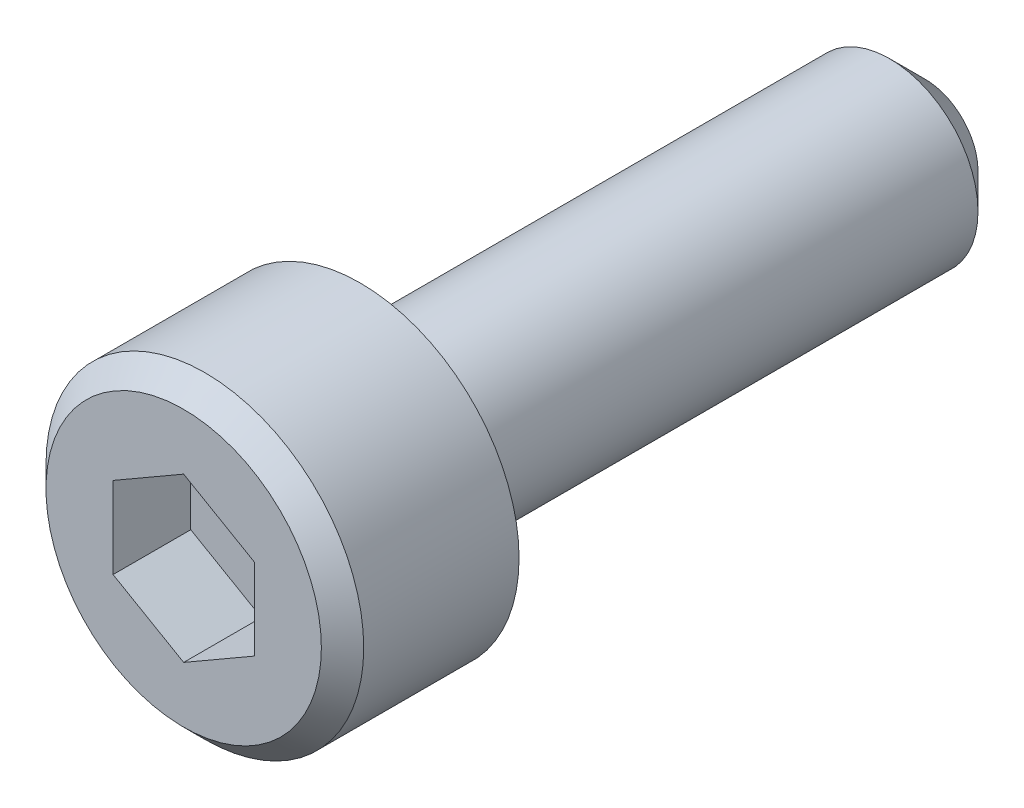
ISO-10303-21;
HEADER;
FILE_DESCRIPTION(('STEP AP214'),'2;1');
FILE_NAME('part.step','',(''),(''),'','','');
FILE_SCHEMA(('AUTOMOTIVE_DESIGN { 1 0 10303 214 1 1 1 1 }'));
ENDSEC;
DATA;
#1=APPLICATION_CONTEXT('core data for automotive mechanical design processes');
#2=APPLICATION_PROTOCOL_DEFINITION('international standard','automotive_design',2000,#1);
#3=PRODUCT_CONTEXT('',#1,'mechanical');
#4=PRODUCT('Part','Part','',(#3));
#5=PRODUCT_RELATED_PRODUCT_CATEGORY('part','',(#4));
#6=PRODUCT_DEFINITION_FORMATION('','',#4);
#7=PRODUCT_DEFINITION_CONTEXT('part definition',#1,'design');
#8=PRODUCT_DEFINITION('design','',#6,#7);
#9=PRODUCT_DEFINITION_SHAPE('','',#8);
#10=(LENGTH_UNIT() NAMED_UNIT(*) SI_UNIT(.MILLI.,.METRE.));
#11=(NAMED_UNIT(*) PLANE_ANGLE_UNIT() SI_UNIT($,.RADIAN.));
#12=(NAMED_UNIT(*) SI_UNIT($,.STERADIAN.) SOLID_ANGLE_UNIT());
#13=UNCERTAINTY_MEASURE_WITH_UNIT(LENGTH_MEASURE(1.E-05),#10,'distance_accuracy_value','');
#14=(GEOMETRIC_REPRESENTATION_CONTEXT(3) GLOBAL_UNCERTAINTY_ASSIGNED_CONTEXT((#13)) GLOBAL_UNIT_ASSIGNED_CONTEXT((#10,
#11,#12)) REPRESENTATION_CONTEXT('',''));
#15=CARTESIAN_POINT('',(0.,0.,0.));
#16=DIRECTION('',(0.,0.,1.));
#17=DIRECTION('',(1.,0.,0.));
#18=AXIS2_PLACEMENT_3D('',#15,#16,#17);
#19=CARTESIAN_POINT('',(0.,0.,2.5));
#20=DIRECTION('',(0.,0.,-1.));
#21=DIRECTION('',(-1.,0.,0.));
#22=AXIS2_PLACEMENT_3D('',#19,#20,#21);
#23=CYLINDRICAL_SURFACE('',#22,2.25);
#24=CARTESIAN_POINT('',(0.,0.,2.2));
#25=DIRECTION('',(0.,0.,1.));
#26=DIRECTION('',(1.,0.,0.));
#27=AXIS2_PLACEMENT_3D('',#24,#25,#26);
#28=CIRCLE('',#27,2.25);
#29=CARTESIAN_POINT('',(2.25,0.,2.2));
#30=VERTEX_POINT('',#29);
#31=EDGE_CURVE('E146',#30,#30,#28,.F.);
#32=ORIENTED_EDGE('',*,*,#31,.T.);
#33=EDGE_LOOP('',(#32));
#34=FACE_BOUND('',#33,.T.);
#35=CARTESIAN_POINT('',(0.,0.,0.));
#36=DIRECTION('',(0.,0.,1.));
#37=DIRECTION('',(1.,0.,0.));
#38=AXIS2_PLACEMENT_3D('',#35,#36,#37);
#39=CIRCLE('',#38,2.25);
#40=CARTESIAN_POINT('',(2.25,0.,0.));
#41=VERTEX_POINT('',#40);
#42=EDGE_CURVE('E139',#41,#41,#39,.T.);
#43=ORIENTED_EDGE('',*,*,#42,.T.);
#44=EDGE_LOOP('',(#43));
#45=FACE_BOUND('',#44,.T.);
#46=ADVANCED_FACE('F17',(#34,#45),#23,.T.);
#47=CARTESIAN_POINT('',(0.,0.,2.5));
#48=DIRECTION('',(0.,0.,1.));
#49=DIRECTION('',(1.,0.,0.));
#50=AXIS2_PLACEMENT_3D('',#47,#48,#49);
#51=PLANE('',#50);
#52=CARTESIAN_POINT('',(0.,0.,2.5));
#53=DIRECTION('',(0.,0.,1.));
#54=DIRECTION('',(1.,0.,0.));
#55=AXIS2_PLACEMENT_3D('',#52,#53,#54);
#56=CIRCLE('',#55,1.95);
#57=CARTESIAN_POINT('',(1.95,0.,2.5));
#58=VERTEX_POINT('',#57);
#59=EDGE_CURVE('E143',#58,#58,#56,.T.);
#60=ORIENTED_EDGE('',*,*,#59,.T.);
#61=EDGE_LOOP('',(#60));
#62=FACE_BOUND('',#61,.T.);
#63=DIRECTION('',(-0.866025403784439,0.5,0.));
#64=VECTOR('',#63,1.);
#65=CARTESIAN_POINT('',(1.,0.577350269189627,2.5));
#66=LINE('',#65,#64);
#67=CARTESIAN_POINT('',(1.,0.577350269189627,2.5));
#68=VERTEX_POINT('',#67);
#69=CARTESIAN_POINT('',(0.,1.15470053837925,2.5));
#70=VERTEX_POINT('',#69);
#71=EDGE_CURVE('E33',#68,#70,#66,.T.);
#72=ORIENTED_EDGE('',*,*,#71,.F.);
#73=DIRECTION('',(0.,1.,0.));
#74=VECTOR('',#73,1.);
#75=CARTESIAN_POINT('',(1.,-0.577350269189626,2.5));
#76=LINE('',#75,#74);
#77=CARTESIAN_POINT('',(1.,-0.577350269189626,2.5));
#78=VERTEX_POINT('',#77);
#79=EDGE_CURVE('E124',#78,#68,#76,.T.);
#80=ORIENTED_EDGE('',*,*,#79,.F.);
#81=DIRECTION('',(0.866025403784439,0.5,0.));
#82=VECTOR('',#81,1.);
#83=CARTESIAN_POINT('',(0.,-1.15470053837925,2.5));
#84=LINE('',#83,#82);
#85=CARTESIAN_POINT('',(0.,-1.15470053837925,2.5));
#86=VERTEX_POINT('',#85);
#87=EDGE_CURVE('E121',#86,#78,#84,.T.);
#88=ORIENTED_EDGE('',*,*,#87,.F.);
#89=DIRECTION('',(0.866025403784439,-0.5,0.));
#90=VECTOR('',#89,1.);
#91=CARTESIAN_POINT('',(-1.,-0.577350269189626,2.5));
#92=LINE('',#91,#90);
#93=CARTESIAN_POINT('',(-1.,-0.577350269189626,2.5));
#94=VERTEX_POINT('',#93);
#95=EDGE_CURVE('E81',#94,#86,#92,.T.);
#96=ORIENTED_EDGE('',*,*,#95,.F.);
#97=DIRECTION('',(0.,-1.,0.));
#98=VECTOR('',#97,1.);
#99=CARTESIAN_POINT('',(-1.,0.577350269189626,2.5));
#100=LINE('',#99,#98);
#101=CARTESIAN_POINT('',(-1.,0.577350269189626,2.5));
#102=VERTEX_POINT('',#101);
#103=EDGE_CURVE('E116',#102,#94,#100,.T.);
#104=ORIENTED_EDGE('',*,*,#103,.F.);
#105=DIRECTION('',(-0.866025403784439,-0.5,0.));
#106=VECTOR('',#105,1.);
#107=CARTESIAN_POINT('',(0.,1.15470053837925,2.5));
#108=LINE('',#107,#106);
#109=EDGE_CURVE('E113',#70,#102,#108,.T.);
#110=ORIENTED_EDGE('',*,*,#109,.F.);
#111=EDGE_LOOP('',(#72,#80,#88,#96,#104,#110));
#112=FACE_BOUND('',#111,.T.);
#113=ADVANCED_FACE('F165',(#62,#112),#51,.T.);
#114=CARTESIAN_POINT('',(0.,0.,0.));
#115=DIRECTION('',(0.,0.,1.));
#116=DIRECTION('',(1.,0.,0.));
#117=AXIS2_PLACEMENT_3D('',#114,#115,#116);
#118=PLANE('',#117);
#119=CARTESIAN_POINT('',(0.,0.,0.));
#120=DIRECTION('',(0.,0.,1.));
#121=DIRECTION('',(1.,0.,0.));
#122=AXIS2_PLACEMENT_3D('',#119,#120,#121);
#123=CIRCLE('',#122,1.25);
#124=CARTESIAN_POINT('',(1.25,0.,0.));
#125=VERTEX_POINT('',#124);
#126=EDGE_CURVE('E128',#125,#125,#123,.T.);
#127=ORIENTED_EDGE('',*,*,#126,.T.);
#128=EDGE_LOOP('',(#127));
#129=FACE_BOUND('',#128,.T.);
#130=ORIENTED_EDGE('',*,*,#42,.F.);
#131=EDGE_LOOP('',(#130));
#132=FACE_BOUND('',#131,.T.);
#133=ADVANCED_FACE('F172',(#129,#132),#118,.F.);
#134=CARTESIAN_POINT('',(0.,0.,-8.));
#135=DIRECTION('',(0.,0.,1.));
#136=DIRECTION('',(1.,0.,0.));
#137=AXIS2_PLACEMENT_3D('',#134,#135,#136);
#138=CYLINDRICAL_SURFACE('',#137,1.25);
#139=CARTESIAN_POINT('',(0.,0.,-7.5));
#140=DIRECTION('',(0.,0.,1.));
#141=DIRECTION('',(1.,0.,0.));
#142=AXIS2_PLACEMENT_3D('',#139,#140,#141);
#143=CIRCLE('',#142,1.25);
#144=CARTESIAN_POINT('',(1.25,0.,-7.5));
#145=VERTEX_POINT('',#144);
#146=EDGE_CURVE('E26',#145,#145,#143,.T.);
#147=ORIENTED_EDGE('',*,*,#146,.T.);
#148=EDGE_LOOP('',(#147));
#149=FACE_BOUND('',#148,.T.);
#150=ORIENTED_EDGE('',*,*,#126,.F.);
#151=EDGE_LOOP('',(#150));
#152=FACE_BOUND('',#151,.T.);
#153=ADVANCED_FACE('F151',(#149,#152),#138,.T.);
#154=CARTESIAN_POINT('',(0.,0.,-8.));
#155=DIRECTION('',(0.,0.,1.));
#156=DIRECTION('',(1.,0.,0.));
#157=AXIS2_PLACEMENT_3D('',#154,#155,#156);
#158=PLANE('',#157);
#159=CARTESIAN_POINT('',(0.,0.,-8.));
#160=DIRECTION('',(0.,0.,1.));
#161=DIRECTION('',(1.,0.,0.));
#162=AXIS2_PLACEMENT_3D('',#159,#160,#161);
#163=CIRCLE('',#162,0.75);
#164=CARTESIAN_POINT('',(0.75,0.,-8.));
#165=VERTEX_POINT('',#164);
#166=EDGE_CURVE('E11',#165,#165,#163,.F.);
#167=ORIENTED_EDGE('',*,*,#166,.T.);
#168=EDGE_LOOP('',(#167));
#169=FACE_BOUND('',#168,.T.);
#170=ADVANCED_FACE('F190',(#169),#158,.F.);
#171=CARTESIAN_POINT('',(1.,0.577350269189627,1.4));
#172=DIRECTION('',(0.5,0.866025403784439,0.));
#173=DIRECTION('',(-0.866025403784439,0.5,0.));
#174=AXIS2_PLACEMENT_3D('',#171,#172,#173);
#175=PLANE('',#174);
#176=ORIENTED_EDGE('',*,*,#71,.T.);
#177=DIRECTION('',(0.,0.,1.));
#178=VECTOR('',#177,1.);
#179=CARTESIAN_POINT('',(0.,1.15470053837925,1.4));
#180=LINE('',#179,#178);
#181=CARTESIAN_POINT('',(0.,1.15470053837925,1.4));
#182=VERTEX_POINT('',#181);
#183=EDGE_CURVE('E63',#182,#70,#180,.T.);
#184=ORIENTED_EDGE('',*,*,#183,.F.);
#185=DIRECTION('',(-0.866025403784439,0.5,0.));
#186=VECTOR('',#185,1.);
#187=CARTESIAN_POINT('',(1.,0.577350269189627,1.4));
#188=LINE('',#187,#186);
#189=CARTESIAN_POINT('',(1.,0.577350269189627,1.4));
#190=VERTEX_POINT('',#189);
#191=EDGE_CURVE('E126',#190,#182,#188,.T.);
#192=ORIENTED_EDGE('',*,*,#191,.F.);
#193=DIRECTION('',(0.,0.,1.));
#194=VECTOR('',#193,1.);
#195=CARTESIAN_POINT('',(1.,0.577350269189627,1.4));
#196=LINE('',#195,#194);
#197=EDGE_CURVE('E41',#190,#68,#196,.T.);
#198=ORIENTED_EDGE('',*,*,#197,.T.);
#199=EDGE_LOOP('',(#176,#184,#192,#198));
#200=FACE_BOUND('',#199,.T.);
#201=ADVANCED_FACE('F193',(#200),#175,.F.);
#202=CARTESIAN_POINT('',(1.,-0.577350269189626,1.4));
#203=DIRECTION('',(1.,0.,0.));
#204=DIRECTION('',(0.,1.,0.));
#205=AXIS2_PLACEMENT_3D('',#202,#203,#204);
#206=PLANE('',#205);
#207=ORIENTED_EDGE('',*,*,#79,.T.);
#208=ORIENTED_EDGE('',*,*,#197,.F.);
#209=DIRECTION('',(0.,1.,0.));
#210=VECTOR('',#209,1.);
#211=CARTESIAN_POINT('',(1.,-0.577350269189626,1.4));
#212=LINE('',#211,#210);
#213=CARTESIAN_POINT('',(1.,-0.577350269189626,1.4));
#214=VERTEX_POINT('',#213);
#215=EDGE_CURVE('E93',#214,#190,#212,.T.);
#216=ORIENTED_EDGE('',*,*,#215,.F.);
#217=DIRECTION('',(0.,0.,1.));
#218=VECTOR('',#217,1.);
#219=CARTESIAN_POINT('',(1.,-0.577350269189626,1.4));
#220=LINE('',#219,#218);
#221=EDGE_CURVE('E85',#214,#78,#220,.T.);
#222=ORIENTED_EDGE('',*,*,#221,.T.);
#223=EDGE_LOOP('',(#207,#208,#216,#222));
#224=FACE_BOUND('',#223,.T.);
#225=ADVANCED_FACE('F197',(#224),#206,.F.);
#226=CARTESIAN_POINT('',(0.,-1.15470053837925,1.4));
#227=DIRECTION('',(0.5,-0.866025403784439,0.));
#228=DIRECTION('',(0.866025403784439,0.5,0.));
#229=AXIS2_PLACEMENT_3D('',#226,#227,#228);
#230=PLANE('',#229);
#231=ORIENTED_EDGE('',*,*,#87,.T.);
#232=ORIENTED_EDGE('',*,*,#221,.F.);
#233=DIRECTION('',(0.866025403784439,0.5,0.));
#234=VECTOR('',#233,1.);
#235=CARTESIAN_POINT('',(0.,-1.15470053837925,1.4));
#236=LINE('',#235,#234);
#237=CARTESIAN_POINT('',(0.,-1.15470053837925,1.4));
#238=VERTEX_POINT('',#237);
#239=EDGE_CURVE('E89',#238,#214,#236,.T.);
#240=ORIENTED_EDGE('',*,*,#239,.F.);
#241=DIRECTION('',(0.,0.,1.));
#242=VECTOR('',#241,1.);
#243=CARTESIAN_POINT('',(0.,-1.15470053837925,1.4));
#244=LINE('',#243,#242);
#245=EDGE_CURVE('E74',#238,#86,#244,.T.);
#246=ORIENTED_EDGE('',*,*,#245,.T.);
#247=EDGE_LOOP('',(#231,#232,#240,#246));
#248=FACE_BOUND('',#247,.T.);
#249=ADVANCED_FACE('F90',(#248),#230,.F.);
#250=CARTESIAN_POINT('',(-1.,-0.577350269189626,1.4));
#251=DIRECTION('',(-0.5,-0.866025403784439,0.));
#252=DIRECTION('',(0.866025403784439,-0.5,0.));
#253=AXIS2_PLACEMENT_3D('',#250,#251,#252);
#254=PLANE('',#253);
#255=ORIENTED_EDGE('',*,*,#95,.T.);
#256=ORIENTED_EDGE('',*,*,#245,.F.);
#257=DIRECTION('',(0.866025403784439,-0.5,0.));
#258=VECTOR('',#257,1.);
#259=CARTESIAN_POINT('',(-1.,-0.577350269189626,1.4));
#260=LINE('',#259,#258);
#261=CARTESIAN_POINT('',(-1.,-0.577350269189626,1.4));
#262=VERTEX_POINT('',#261);
#263=EDGE_CURVE('E78',#262,#238,#260,.T.);
#264=ORIENTED_EDGE('',*,*,#263,.F.);
#265=DIRECTION('',(0.,0.,1.));
#266=VECTOR('',#265,1.);
#267=CARTESIAN_POINT('',(-1.,-0.577350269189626,1.4));
#268=LINE('',#267,#266);
#269=EDGE_CURVE('E86',#262,#94,#268,.T.);
#270=ORIENTED_EDGE('',*,*,#269,.T.);
#271=EDGE_LOOP('',(#255,#256,#264,#270));
#272=FACE_BOUND('',#271,.T.);
#273=ADVANCED_FACE('F76',(#272),#254,.F.);
#274=CARTESIAN_POINT('',(-1.,0.577350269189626,1.4));
#275=DIRECTION('',(-1.,0.,0.));
#276=DIRECTION('',(0.,0.,1.));
#277=AXIS2_PLACEMENT_3D('',#274,#275,#276);
#278=PLANE('',#277);
#279=ORIENTED_EDGE('',*,*,#103,.T.);
#280=ORIENTED_EDGE('',*,*,#269,.F.);
#281=DIRECTION('',(0.,-1.,0.));
#282=VECTOR('',#281,1.);
#283=CARTESIAN_POINT('',(-1.,0.577350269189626,1.4));
#284=LINE('',#283,#282);
#285=CARTESIAN_POINT('',(-1.,0.577350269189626,1.4));
#286=VERTEX_POINT('',#285);
#287=EDGE_CURVE('E99',#286,#262,#284,.T.);
#288=ORIENTED_EDGE('',*,*,#287,.F.);
#289=DIRECTION('',(0.,0.,1.));
#290=VECTOR('',#289,1.);
#291=CARTESIAN_POINT('',(-1.,0.577350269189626,1.4));
#292=LINE('',#291,#290);
#293=EDGE_CURVE('E132',#286,#102,#292,.T.);
#294=ORIENTED_EDGE('',*,*,#293,.T.);
#295=EDGE_LOOP('',(#279,#280,#288,#294));
#296=FACE_BOUND('',#295,.T.);
#297=ADVANCED_FACE('F201',(#296),#278,.F.);
#298=CARTESIAN_POINT('',(0.,1.15470053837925,1.4));
#299=DIRECTION('',(-0.5,0.866025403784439,0.));
#300=DIRECTION('',(-0.866025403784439,-0.5,0.));
#301=AXIS2_PLACEMENT_3D('',#298,#299,#300);
#302=PLANE('',#301);
#303=ORIENTED_EDGE('',*,*,#109,.T.);
#304=ORIENTED_EDGE('',*,*,#293,.F.);
#305=DIRECTION('',(-0.866025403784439,-0.5,0.));
#306=VECTOR('',#305,1.);
#307=CARTESIAN_POINT('',(0.,1.15470053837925,1.4));
#308=LINE('',#307,#306);
#309=EDGE_CURVE('E106',#182,#286,#308,.T.);
#310=ORIENTED_EDGE('',*,*,#309,.F.);
#311=ORIENTED_EDGE('',*,*,#183,.T.);
#312=EDGE_LOOP('',(#303,#304,#310,#311));
#313=FACE_BOUND('',#312,.T.);
#314=ADVANCED_FACE('F198',(#313),#302,.F.);
#315=CARTESIAN_POINT('',(0.,0.,1.4));
#316=DIRECTION('',(0.,0.,1.));
#317=DIRECTION('',(1.,0.,0.));
#318=AXIS2_PLACEMENT_3D('',#315,#316,#317);
#319=PLANE('',#318);
#320=ORIENTED_EDGE('',*,*,#191,.T.);
#321=ORIENTED_EDGE('',*,*,#309,.T.);
#322=ORIENTED_EDGE('',*,*,#287,.T.);
#323=ORIENTED_EDGE('',*,*,#263,.T.);
#324=ORIENTED_EDGE('',*,*,#239,.T.);
#325=ORIENTED_EDGE('',*,*,#215,.T.);
#326=EDGE_LOOP('',(#320,#321,#322,#323,#324,#325));
#327=FACE_BOUND('',#326,.T.);
#328=ADVANCED_FACE('F96',(#327),#319,.T.);
#329=CARTESIAN_POINT('',(0.,0.,2.5));
#330=DIRECTION('',(0.,0.,-1.));
#331=DIRECTION('',(-1.,0.,0.));
#332=AXIS2_PLACEMENT_3D('',#329,#330,#331);
#333=CONICAL_SURFACE('',#332,1.95,0.785398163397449);
#334=ORIENTED_EDGE('',*,*,#31,.F.);
#335=EDGE_LOOP('',(#334));
#336=FACE_BOUND('',#335,.T.);
#337=ORIENTED_EDGE('',*,*,#59,.F.);
#338=EDGE_LOOP('',(#337));
#339=FACE_BOUND('',#338,.T.);
#340=ADVANCED_FACE('F155',(#336,#339),#333,.T.);
#341=CARTESIAN_POINT('',(0.,0.,-7.5));
#342=DIRECTION('',(0.,0.,1.));
#343=DIRECTION('',(1.,0.,0.));
#344=AXIS2_PLACEMENT_3D('',#341,#342,#343);
#345=CONICAL_SURFACE('',#344,1.25,0.785398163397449);
#346=ORIENTED_EDGE('',*,*,#166,.F.);
#347=EDGE_LOOP('',(#346));
#348=FACE_BOUND('',#347,.T.);
#349=ORIENTED_EDGE('',*,*,#146,.F.);
#350=EDGE_LOOP('',(#349));
#351=FACE_BOUND('',#350,.T.);
#352=ADVANCED_FACE('F20',(#348,#351),#345,.T.);
#353=CLOSED_SHELL('',(#46,#113,#133,#153,#170,#201,#225,#249,#273,#297,#314,#328,#340,#352));
#354=MANIFOLD_SOLID_BREP('B1',#353);
#355=ADVANCED_BREP_SHAPE_REPRESENTATION('',(#18,#354),#14);
#356=SHAPE_DEFINITION_REPRESENTATION(#9,#355);
ENDSEC;
END-ISO-10303-21;
